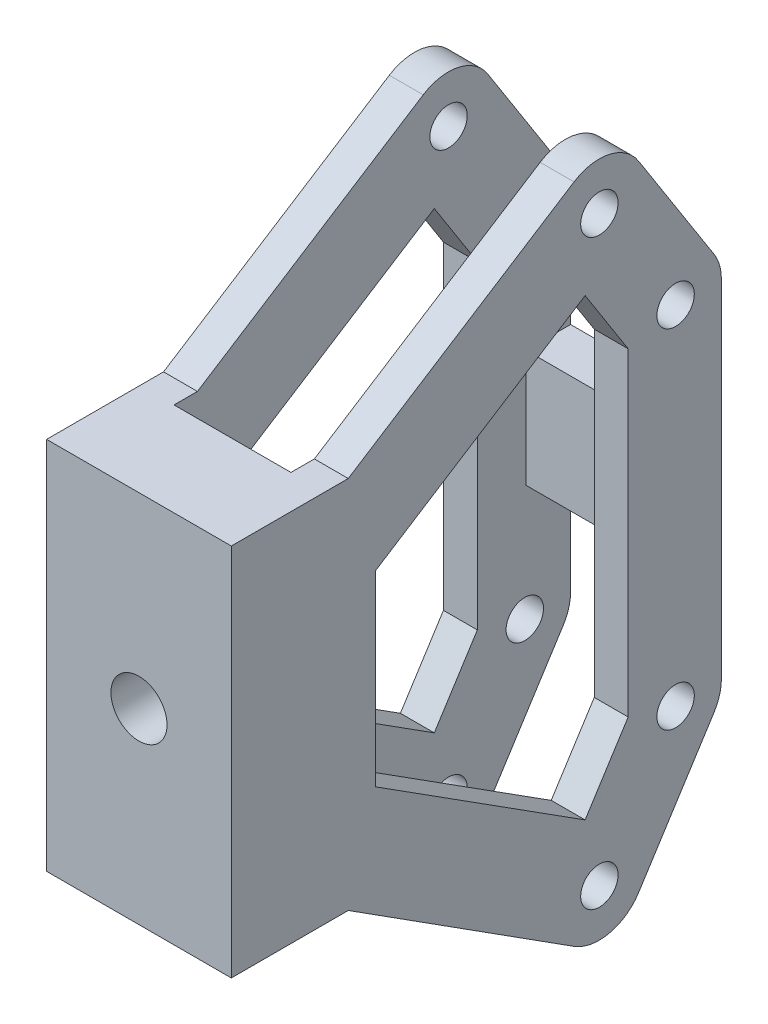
from build123d import *

# Parameters (mm, degrees)
SKETCH1_R               = 4
BOSS_EXTRUDE1_DEPTH     = 39.5
CUT_EXTRUDE1_DEPTH      = 105.5
CUT_EXTRUDE1_DEPTH_BACK = 117.5
SKETCH2_W               = 25
SKETCH2_H               = 75.25
CUT_EXTRUDE2_DEPTH      = 43.5
SKETCH4_R               = 6
CUT_EXTRUDE3_DEPTH      = 41


with BuildPart() as part:
    # Sketch1 → Boss-Extrude1 (new body)
    with BuildSketch(Plane(origin=(0, 0, 0), x_dir=(0, 0, -1), z_dir=(1, 0, 0))):
        with BuildLine():
            Line((0, -40), (0, 40))
            Line((0, 40), (25, 40))
            Line((25, 40), (73.280107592, 70.785366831))
            ThreePointArc((73.280107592, 70.785366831), (80.81695996, 72.117470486), (87.088258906, 67.730050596))
            Line((87.088258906, 67.730050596), (103.222887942, 42.426417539))
            ThreePointArc((103.222887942, 42.426417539), (104.391084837, 39.850237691), (104.791154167, 37.05))
            Line((104.791154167, 37.05), (104.791154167, -37.05))
            ThreePointArc((104.791154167, -37.05), (104.391084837, -39.850237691), (103.222887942, -42.426417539))
            Line((103.222887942, -42.426417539), (87.088258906, -67.730050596))
            ThreePointArc((87.088258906, -67.730050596), (80.81695996, -72.117470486), (73.280107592, -70.785366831))
            Line((73.280107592, -70.785366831), (25, -40))
            Line((25, -40), (0, -40))
        make_face()
        with Locations((78.7, 62.25)):
            Circle(SKETCH1_R, mode=Mode.SUBTRACT)
        with Locations((95, 37.153633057)):
            Circle(SKETCH1_R, mode=Mode.SUBTRACT)
        with Locations(Location((95, -37.153633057, 0), (0, 0, 180))):
            Circle(SKETCH1_R, mode=Mode.SUBTRACT)
        with Locations(Location((78.7, -62.25, 0), (0, 0, 180))):
            Circle(SKETCH1_R, mode=Mode.SUBTRACT)
        Polygon((30.81, -20), (30.81, 20), (75.651092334, 48.552793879), (84.857166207, 34.095), (84.857166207, -34.095), (75.651092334, -48.552793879), align=None, mode=Mode.SUBTRACT)
    extrude(amount=BOSS_EXTRUDE1_DEPTH)

    # Sketch2 → Cut-Extrude1 (cut, two sides: drawn at the far end of the back side and taken through both)
    with BuildSketch(Plane(origin=(0, 0, 0), x_dir=(1, 0, 0), z_dir=(0, 1, 0)).offset(-CUT_EXTRUDE1_DEPTH_BACK)):
        with Locations((19.75, 57.625)):
            Rectangle(SKETCH2_W, SKETCH2_H)
    extrude(amount=CUT_EXTRUDE1_DEPTH + CUT_EXTRUDE1_DEPTH_BACK, mode=Mode.SUBTRACT)

    # Sketch3 → Cut-Extrude2 (cut)
    with BuildSketch(Plane(origin=(0, 0, -104.791154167), x_dir=(-1, 0, 0), z_dir=(0, 0, -1))):
        Polygon((-7.25, -37.05), (-7.25, -12.5), (-32.25, -12.5), (-32.25, -37.05), (-32.25, -54.930146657), (-7.25, -54.930146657), align=None)
        Polygon((-32.25, 37.05), (-32.25, 12.5), (-7.25, 12.5), (-7.25, 37.05), (-7.25, 54.930146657), (-32.25, 54.930146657), align=None)
    extrude(amount=-CUT_EXTRUDE2_DEPTH, mode=Mode.SUBTRACT)

    # Sketch4 → Cut-Extrude3 (cut)
    with BuildSketch(Plane.XY):
        with Locations((19.75, 0)):
            Circle(SKETCH4_R)
    extrude(amount=-CUT_EXTRUDE3_DEPTH, mode=Mode.SUBTRACT)


solid = part.part
